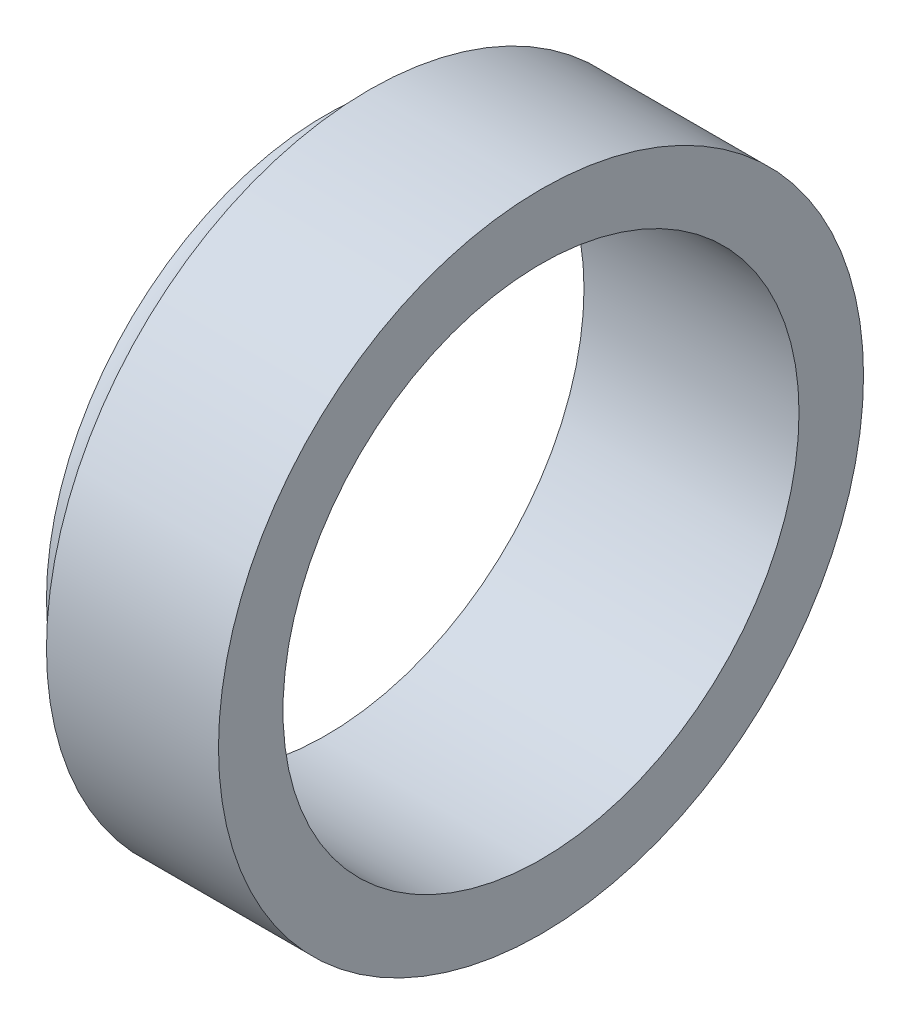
from build123d import *


with BuildPart() as part:
    # Esquisse1 → R_volution1 (revolve)
    with BuildSketch(Plane.XY, mode=Mode.PRIVATE) as r_volution1_sk:
        with BuildLine():
            Line((0, 6), (0, 6.5))
            ThreePointArc((0, 6.5), (0.707106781, 6.792893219), (1, 7.5))
            Line((1, 7.5), (5, 7.5))
            Line((5, 7.5), (5, 6))
            Line((5, 6), (0, 6))
        make_face()
    revolve(r_volution1_sk.sketch.rotate(Axis((0, 0, 0), (-1, 0, 0)), 90), axis=Axis((0, 0, 0), (-1, 0, 0)))


solid = part.part
